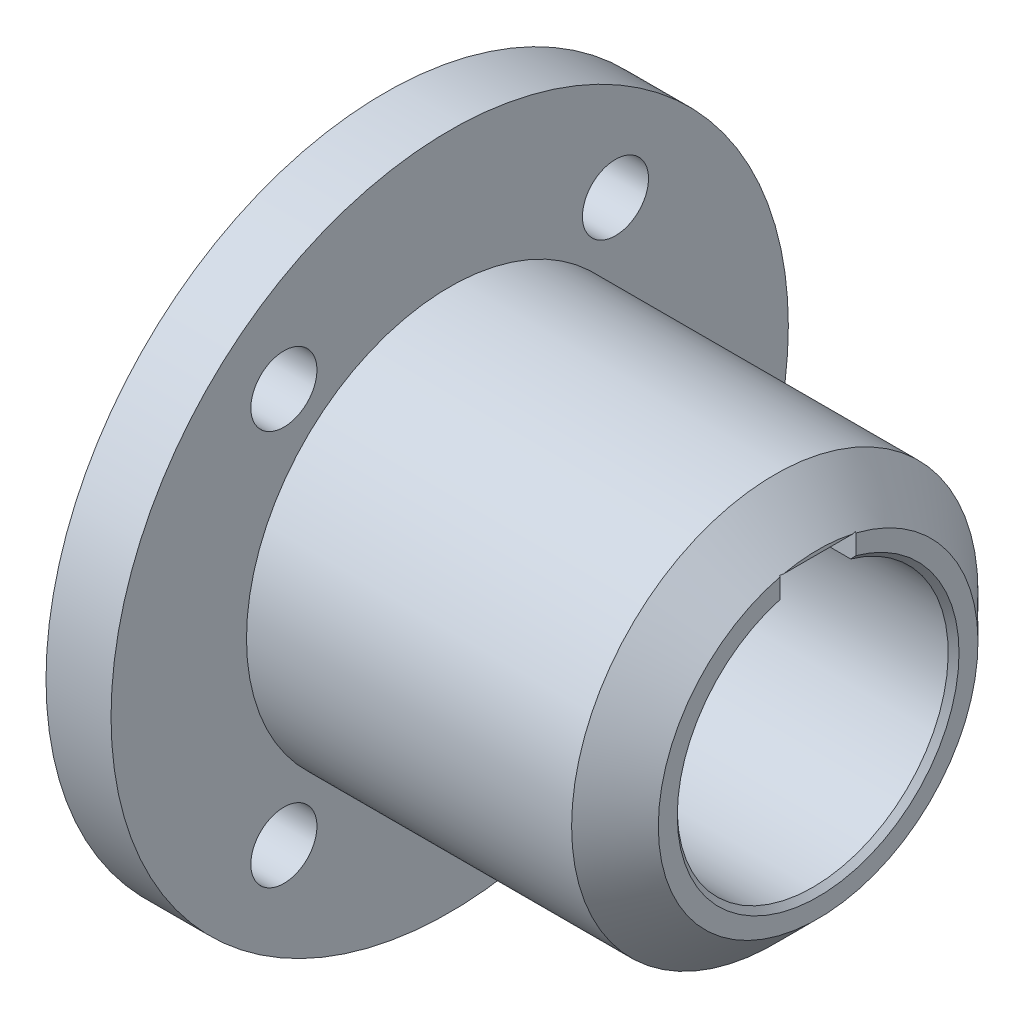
from build123d import *

# Parameters (mm, degrees)
ESQUISSE2_W             = 14
ESQUISSE2_H             = 11.873390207
ENL_V_MAT_EXTRU_1_DEPTH = 120.216190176
ESQUISSE3_R             = 6.1
ENL_V_MAT_EXTRU_2_DEPTH = 120.216190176


with BuildPart() as part:
    # Esquisse1 → R_volution1 (revolve)
    with BuildSketch(Plane.XY, mode=Mode.PRIVATE) as r_volution1_sk:
        Polygon((0, 62.5), (12, 62.5), (12, 37.5), (72, 37.5), (80, 29.5), (80, 26), (79, 25), (18, 25), (18, 31), (3, 31), (3, 34.925), (0, 34.925), align=None)
    revolve(r_volution1_sk.sketch.rotate(Axis((0, 0, 0), (1, 0, 0)), 90), axis=Axis((0, 0, 0), (1, 0, 0)))

    # Esquisse2 → Enl_v. mat.-Extru.1 (cut, through all)
    with BuildSketch(Plane(origin=(80, 0, 0), x_dir=(0, 0, -1), z_dir=(1, 0, 0))):
        with Locations((0, 22.863304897)):
            Rectangle(ESQUISSE2_W, ESQUISSE2_H)
    extrude(amount=-ENL_V_MAT_EXTRU_1_DEPTH, mode=Mode.SUBTRACT)

    # Esquisse3 → Enl_v. mat.-Extru.2 (cut, through all)
    with BuildSketch(Plane.ZY):
        with Locations((30.596690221, 36.463715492)):
            Circle(ESQUISSE3_R)
        with Locations((30.596690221, -36.463715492)):
            Circle(ESQUISSE3_R)
    enl_v_mat_extru_2 = extrude(amount=-ENL_V_MAT_EXTRU_2_DEPTH, mode=Mode.SUBTRACT)

    # Sym_trie1: Enl_v. mat.-Extru.2 across plane
    add(enl_v_mat_extru_2.mirror(Plane.XY), mode=Mode.SUBTRACT)


solid = part.part
